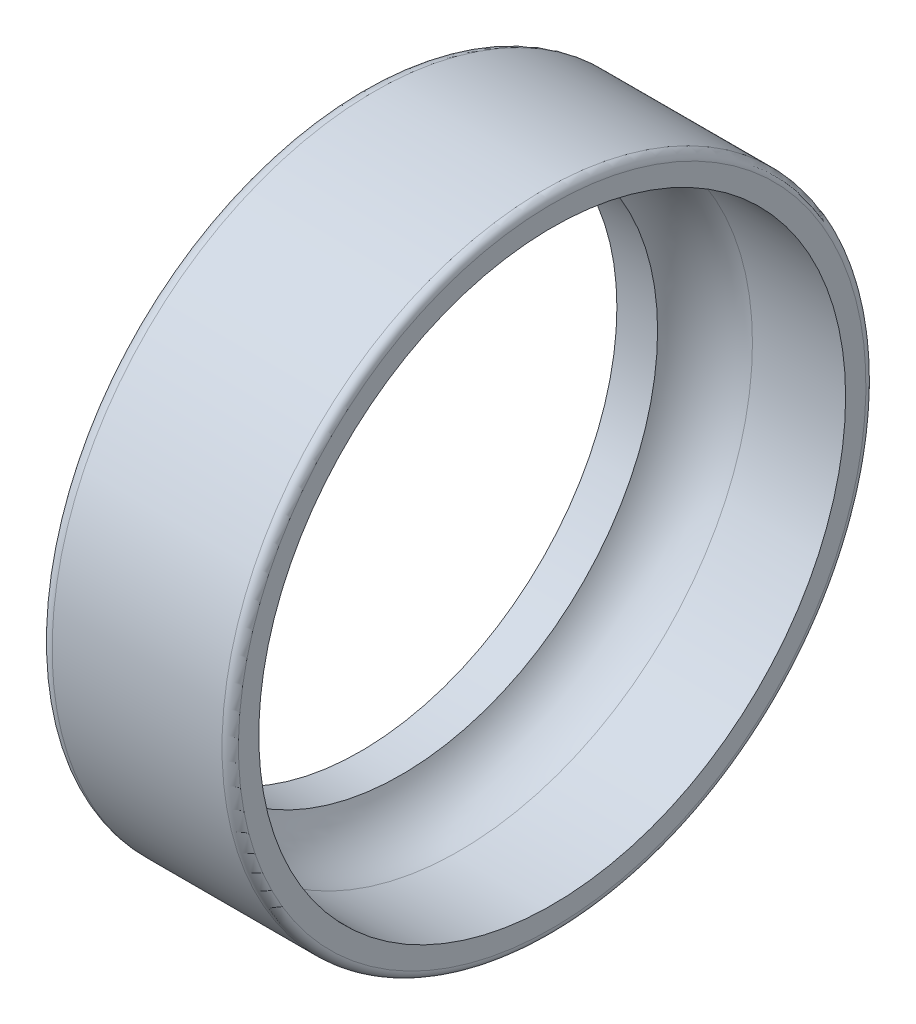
ISO-10303-21;
HEADER;
FILE_DESCRIPTION(('STEP AP214'),'2;1');
FILE_NAME('part.step','',(''),(''),'','','');
FILE_SCHEMA(('AUTOMOTIVE_DESIGN { 1 0 10303 214 1 1 1 1 }'));
ENDSEC;
DATA;
#1=APPLICATION_CONTEXT('core data for automotive mechanical design processes');
#2=APPLICATION_PROTOCOL_DEFINITION('international standard','automotive_design',2000,#1);
#3=PRODUCT_CONTEXT('',#1,'mechanical');
#4=PRODUCT('Part','Part','',(#3));
#5=PRODUCT_RELATED_PRODUCT_CATEGORY('part','',(#4));
#6=PRODUCT_DEFINITION_FORMATION('','',#4);
#7=PRODUCT_DEFINITION_CONTEXT('part definition',#1,'design');
#8=PRODUCT_DEFINITION('design','',#6,#7);
#9=PRODUCT_DEFINITION_SHAPE('','',#8);
#10=(LENGTH_UNIT() NAMED_UNIT(*) SI_UNIT(.MILLI.,.METRE.));
#11=(NAMED_UNIT(*) PLANE_ANGLE_UNIT() SI_UNIT($,.RADIAN.));
#12=(NAMED_UNIT(*) SI_UNIT($,.STERADIAN.) SOLID_ANGLE_UNIT());
#13=UNCERTAINTY_MEASURE_WITH_UNIT(LENGTH_MEASURE(1.E-05),#10,'distance_accuracy_value','');
#14=(GEOMETRIC_REPRESENTATION_CONTEXT(3) GLOBAL_UNCERTAINTY_ASSIGNED_CONTEXT((#13)) GLOBAL_UNIT_ASSIGNED_CONTEXT((#10,
#11,#12)) REPRESENTATION_CONTEXT('',''));
#15=CARTESIAN_POINT('',(0.,0.,0.));
#16=DIRECTION('',(0.,0.,1.));
#17=DIRECTION('',(1.,0.,0.));
#18=AXIS2_PLACEMENT_3D('',#15,#16,#17);
#19=CARTESIAN_POINT('',(7.2,0.,0.));
#20=DIRECTION('',(1.,0.,0.));
#21=DIRECTION('',(0.,0.877582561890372,0.479425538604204));
#22=AXIS2_PLACEMENT_3D('',#19,#20,#21);
#23=TOROIDAL_SURFACE('',#22,16.75,4.66666666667);
#24=CARTESIAN_POINT('',(2.9705636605,0.,0.));
#25=DIRECTION('',(1.,0.,0.));
#26=DIRECTION('',(0.,0.,-1.));
#27=AXIS2_PLACEMENT_3D('',#24,#25,#26);
#28=CIRCLE('',#27,18.7222185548);
#29=CARTESIAN_POINT('',(2.9705636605,0.,-18.7222185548));
#30=VERTEX_POINT('',#29);
#31=EDGE_CURVE('E190',#30,#30,#28,.F.);
#32=ORIENTED_EDGE('',*,*,#31,.T.);
#33=EDGE_LOOP('',(#32));
#34=FACE_BOUND('',#33,.T.);
#35=CARTESIAN_POINT('',(7.2,0.,0.));
#36=DIRECTION('',(1.,0.,0.));
#37=DIRECTION('',(0.,0.,-1.));
#38=AXIS2_PLACEMENT_3D('',#35,#36,#37);
#39=CIRCLE('',#38,21.4166666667);
#40=CARTESIAN_POINT('',(7.2,0.,-21.4166666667));
#41=VERTEX_POINT('',#40);
#42=EDGE_CURVE('E187',#41,#41,#39,.T.);
#43=ORIENTED_EDGE('',*,*,#42,.T.);
#44=EDGE_LOOP('',(#43));
#45=FACE_BOUND('',#44,.T.);
#46=ADVANCED_FACE('F17',(#34,#45),#23,.F.);
#47=CARTESIAN_POINT('',(7.,0.,0.));
#48=DIRECTION('',(1.,0.,0.));
#49=DIRECTION('',(0.,0.,-1.));
#50=AXIS2_PLACEMENT_3D('',#47,#48,#49);
#51=CYLINDRICAL_SURFACE('',#50,21.4166666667);
#52=ORIENTED_EDGE('',*,*,#42,.F.);
#53=EDGE_LOOP('',(#52));
#54=FACE_BOUND('',#53,.T.);
#55=CARTESIAN_POINT('',(14.,0.,0.));
#56=DIRECTION('',(1.,0.,0.));
#57=DIRECTION('',(0.,0.,-1.));
#58=AXIS2_PLACEMENT_3D('',#55,#56,#57);
#59=CIRCLE('',#58,21.4166666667);
#60=CARTESIAN_POINT('',(14.,0.,-21.4166666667));
#61=VERTEX_POINT('',#60);
#62=EDGE_CURVE('E52',#61,#61,#59,.F.);
#63=ORIENTED_EDGE('',*,*,#62,.F.);
#64=EDGE_LOOP('',(#63));
#65=FACE_BOUND('',#64,.T.);
#66=ADVANCED_FACE('F136',(#54,#65),#51,.F.);
#67=CARTESIAN_POINT('',(7.,0.,0.));
#68=DIRECTION('',(1.,0.,0.));
#69=DIRECTION('',(0.,0.,-1.));
#70=AXIS2_PLACEMENT_3D('',#67,#68,#69);
#71=CYLINDRICAL_SURFACE('',#70,18.7222185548);
#72=CARTESIAN_POINT('',(0.,0.,0.));
#73=DIRECTION('',(1.,0.,0.));
#74=DIRECTION('',(0.,0.,-1.));
#75=AXIS2_PLACEMENT_3D('',#72,#73,#74);
#76=CIRCLE('',#75,18.7222185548);
#77=CARTESIAN_POINT('',(0.,0.,-18.7222185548));
#78=VERTEX_POINT('',#77);
#79=EDGE_CURVE('E59',#78,#78,#76,.F.);
#80=ORIENTED_EDGE('',*,*,#79,.T.);
#81=EDGE_LOOP('',(#80));
#82=FACE_BOUND('',#81,.T.);
#83=ORIENTED_EDGE('',*,*,#31,.F.);
#84=EDGE_LOOP('',(#83));
#85=FACE_BOUND('',#84,.T.);
#86=ADVANCED_FACE('F129',(#82,#85),#71,.F.);
#87=CARTESIAN_POINT('',(14.,22.9,0.));
#88=DIRECTION('',(1.,0.,0.));
#89=DIRECTION('',(0.,0.,-1.));
#90=AXIS2_PLACEMENT_3D('',#87,#88,#89);
#91=PLANE('',#90);
#92=ORIENTED_EDGE('',*,*,#62,.T.);
#93=EDGE_LOOP('',(#92));
#94=FACE_BOUND('',#93,.T.);
#95=CARTESIAN_POINT('',(14.,0.,0.));
#96=DIRECTION('',(-1.,0.,0.));
#97=DIRECTION('',(0.,0.877582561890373,0.479425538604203));
#98=AXIS2_PLACEMENT_3D('',#95,#96,#97);
#99=CIRCLE('',#98,22.8999999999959);
#100=CARTESIAN_POINT('',(14.,20.0966406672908,10.9788448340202));
#101=VERTEX_POINT('',#100);
#102=CARTESIAN_POINT('',(14.,-20.0966406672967,-10.9788448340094));
#103=VERTEX_POINT('',#102);
#104=EDGE_CURVE('E50',#101,#103,#99,.T.);
#105=ORIENTED_EDGE('',*,*,#104,.F.);
#106=CARTESIAN_POINT('',(14.,0.,0.));
#107=DIRECTION('',(-1.,0.,0.));
#108=DIRECTION('',(0.,-0.877582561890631,-0.47942553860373));
#109=AXIS2_PLACEMENT_3D('',#106,#107,#108);
#110=CIRCLE('',#109,22.8999999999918);
#111=EDGE_CURVE('E44',#103,#101,#110,.T.);
#112=ORIENTED_EDGE('',*,*,#111,.F.);
#113=EDGE_LOOP('',(#105,#112));
#114=FACE_BOUND('',#113,.T.);
#115=ADVANCED_FACE('F49',(#94,#114),#91,.T.);
#116=CARTESIAN_POINT('',(0.,18.7222185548,0.));
#117=DIRECTION('',(1.,0.,0.));
#118=DIRECTION('',(0.,0.,-1.));
#119=AXIS2_PLACEMENT_3D('',#116,#117,#118);
#120=PLANE('',#119);
#121=ORIENTED_EDGE('',*,*,#79,.F.);
#122=EDGE_LOOP('',(#121));
#123=FACE_BOUND('',#122,.T.);
#124=CARTESIAN_POINT('',(0.,0.,0.));
#125=DIRECTION('',(1.,0.,0.));
#126=DIRECTION('',(0.,-0.877582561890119,-0.479425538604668));
#127=AXIS2_PLACEMENT_3D('',#124,#125,#126);
#128=CIRCLE('',#127,22.4999999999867);
#129=CARTESIAN_POINT('',(0.,-19.7456076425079,-10.7870746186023));
#130=VERTEX_POINT('',#129);
#131=CARTESIAN_POINT('',(0.,19.745607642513,10.7870746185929));
#132=VERTEX_POINT('',#131);
#133=EDGE_CURVE('E58',#130,#132,#128,.T.);
#134=ORIENTED_EDGE('',*,*,#133,.F.);
#135=CARTESIAN_POINT('',(0.,0.,0.));
#136=DIRECTION('',(1.,0.,0.));
#137=DIRECTION('',(0.,0.877582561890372,0.479425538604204));
#138=AXIS2_PLACEMENT_3D('',#135,#136,#137);
#139=CIRCLE('',#138,22.4999999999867);
#140=EDGE_CURVE('E36',#132,#130,#139,.T.);
#141=ORIENTED_EDGE('',*,*,#140,.F.);
#142=EDGE_LOOP('',(#134,#141));
#143=FACE_BOUND('',#142,.T.);
#144=ADVANCED_FACE('F79',(#123,#143),#120,.F.);
#145=CARTESIAN_POINT('',(13.4,0.,0.));
#146=DIRECTION('',(1.,0.,0.));
#147=DIRECTION('',(0.,0.877582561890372,0.479425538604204));
#148=AXIS2_PLACEMENT_3D('',#145,#146,#147);
#149=TOROIDAL_SURFACE('',#148,22.9,0.6);
#150=ORIENTED_EDGE('',*,*,#111,.T.);
#151=ORIENTED_EDGE('',*,*,#104,.T.);
#152=EDGE_LOOP('',(#150,#151));
#153=FACE_BOUND('',#152,.T.);
#154=CARTESIAN_POINT('',(13.4,0.,0.));
#155=DIRECTION('',(1.,0.,0.));
#156=DIRECTION('',(0.,0.,-1.));
#157=AXIS2_PLACEMENT_3D('',#154,#155,#156);
#158=CIRCLE('',#157,23.5);
#159=CARTESIAN_POINT('',(13.4,0.,-23.5));
#160=VERTEX_POINT('',#159);
#161=EDGE_CURVE('E28',#160,#160,#158,.F.);
#162=ORIENTED_EDGE('',*,*,#161,.F.);
#163=EDGE_LOOP('',(#162));
#164=FACE_BOUND('',#163,.T.);
#165=ADVANCED_FACE('F56',(#153,#164),#149,.T.);
#166=CARTESIAN_POINT('',(1.,0.,0.));
#167=DIRECTION('',(1.,0.,0.));
#168=DIRECTION('',(0.,0.877582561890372,0.479425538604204));
#169=AXIS2_PLACEMENT_3D('',#166,#167,#168);
#170=TOROIDAL_SURFACE('',#169,22.5,1.);
#171=CARTESIAN_POINT('',(1.,0.,0.));
#172=DIRECTION('',(1.,0.,0.));
#173=DIRECTION('',(0.,0.,-1.));
#174=AXIS2_PLACEMENT_3D('',#171,#172,#173);
#175=CIRCLE('',#174,23.5);
#176=CARTESIAN_POINT('',(1.,0.,-23.5));
#177=VERTEX_POINT('',#176);
#178=EDGE_CURVE('E11',#177,#177,#175,.T.);
#179=ORIENTED_EDGE('',*,*,#178,.F.);
#180=EDGE_LOOP('',(#179));
#181=FACE_BOUND('',#180,.T.);
#182=ORIENTED_EDGE('',*,*,#140,.T.);
#183=ORIENTED_EDGE('',*,*,#133,.T.);
#184=EDGE_LOOP('',(#182,#183));
#185=FACE_BOUND('',#184,.T.);
#186=ADVANCED_FACE('F78',(#181,#185),#170,.T.);
#187=CARTESIAN_POINT('',(7.,0.,0.));
#188=DIRECTION('',(1.,0.,0.));
#189=DIRECTION('',(0.,0.,-1.));
#190=AXIS2_PLACEMENT_3D('',#187,#188,#189);
#191=CYLINDRICAL_SURFACE('',#190,23.5);
#192=ORIENTED_EDGE('',*,*,#161,.T.);
#193=EDGE_LOOP('',(#192));
#194=FACE_BOUND('',#193,.T.);
#195=ORIENTED_EDGE('',*,*,#178,.T.);
#196=EDGE_LOOP('',(#195));
#197=FACE_BOUND('',#196,.T.);
#198=ADVANCED_FACE('F19',(#194,#197),#191,.T.);
#199=CLOSED_SHELL('',(#46,#66,#86,#115,#144,#165,#186,#198));
#200=MANIFOLD_SOLID_BREP('B1',#199);
#201=ADVANCED_BREP_SHAPE_REPRESENTATION('',(#18,#200),#14);
#202=SHAPE_DEFINITION_REPRESENTATION(#9,#201);
ENDSEC;
END-ISO-10303-21;
